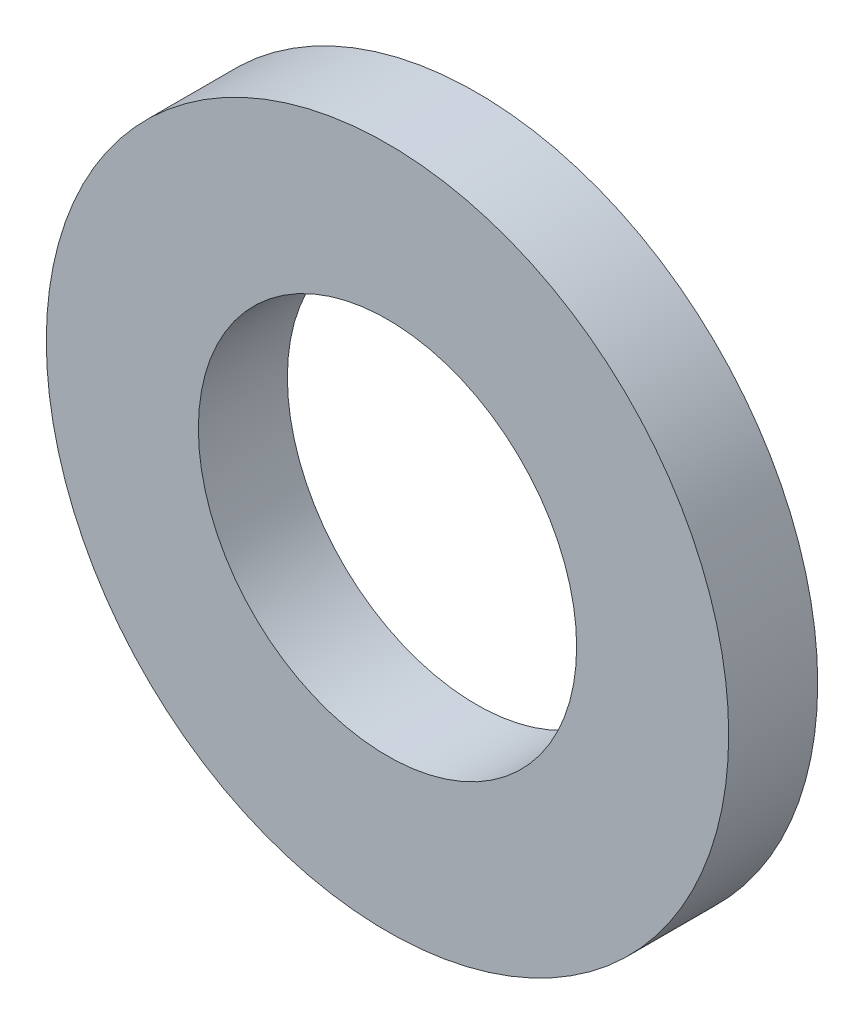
from build123d import *

# Parameters (mm, degrees)
SKIZZE1_R               = 4.6
SKIZZE1_R_2             = 2.55
LINEAR_AUSTRAGEN1_DEPTH = 1.2


with BuildPart() as part:
    # Skizze1 → Linear austragen1 (new body)
    with BuildSketch(Plane.XY):
        Circle(SKIZZE1_R)
        Circle(SKIZZE1_R_2, mode=Mode.SUBTRACT)
    extrude(amount=LINEAR_AUSTRAGEN1_DEPTH)


solid = part.part
